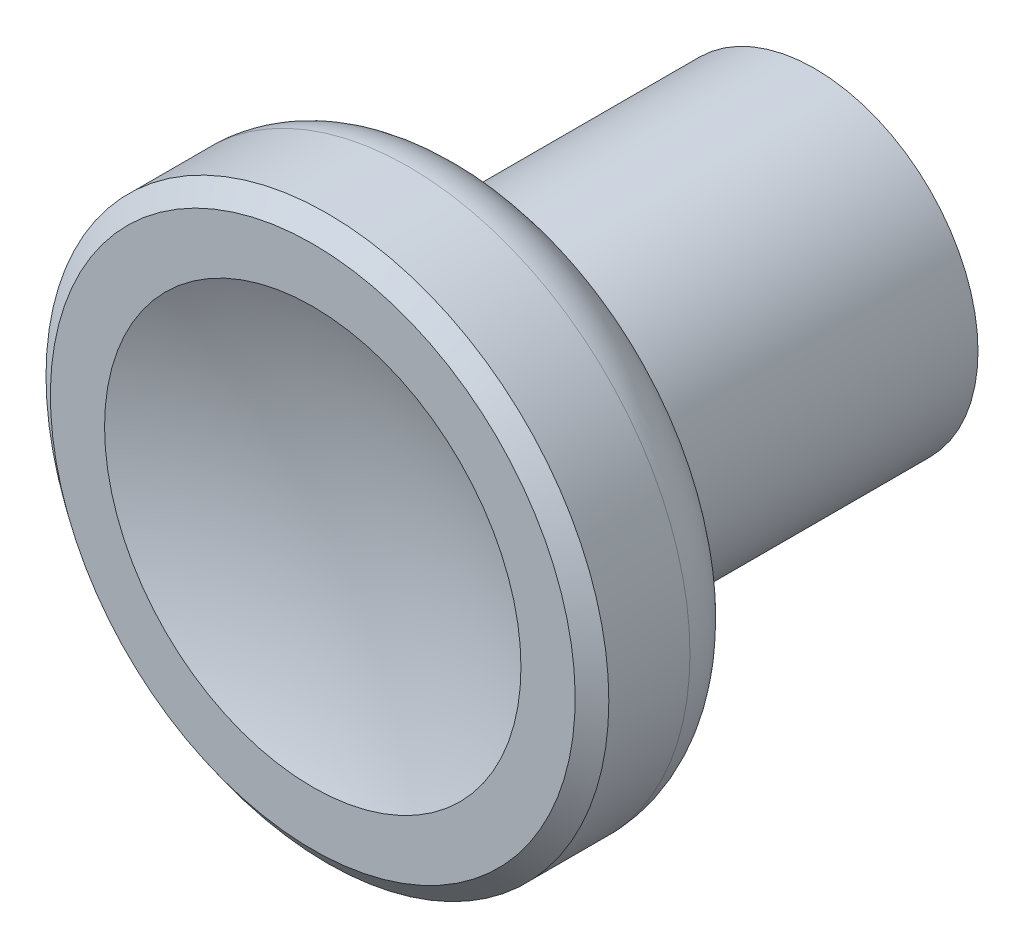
ISO-10303-21;
HEADER;
FILE_DESCRIPTION(('STEP AP214'),'2;1');
FILE_NAME('part.step','',(''),(''),'','','');
FILE_SCHEMA(('AUTOMOTIVE_DESIGN { 1 0 10303 214 1 1 1 1 }'));
ENDSEC;
DATA;
#1=APPLICATION_CONTEXT('core data for automotive mechanical design processes');
#2=APPLICATION_PROTOCOL_DEFINITION('international standard','automotive_design',2000,#1);
#3=PRODUCT_CONTEXT('',#1,'mechanical');
#4=PRODUCT('Part','Part','',(#3));
#5=PRODUCT_RELATED_PRODUCT_CATEGORY('part','',(#4));
#6=PRODUCT_DEFINITION_FORMATION('','',#4);
#7=PRODUCT_DEFINITION_CONTEXT('part definition',#1,'design');
#8=PRODUCT_DEFINITION('design','',#6,#7);
#9=PRODUCT_DEFINITION_SHAPE('','',#8);
#10=(LENGTH_UNIT() NAMED_UNIT(*) SI_UNIT(.MILLI.,.METRE.));
#11=(NAMED_UNIT(*) PLANE_ANGLE_UNIT() SI_UNIT($,.RADIAN.));
#12=(NAMED_UNIT(*) SI_UNIT($,.STERADIAN.) SOLID_ANGLE_UNIT());
#13=UNCERTAINTY_MEASURE_WITH_UNIT(LENGTH_MEASURE(1.E-05),#10,'distance_accuracy_value','');
#14=(GEOMETRIC_REPRESENTATION_CONTEXT(3) GLOBAL_UNCERTAINTY_ASSIGNED_CONTEXT((#13)) GLOBAL_UNIT_ASSIGNED_CONTEXT((#10,
#11,#12)) REPRESENTATION_CONTEXT('',''));
#15=CARTESIAN_POINT('',(0.,0.,0.));
#16=DIRECTION('',(0.,0.,1.));
#17=DIRECTION('',(1.,0.,0.));
#18=AXIS2_PLACEMENT_3D('',#15,#16,#17);
#19=CARTESIAN_POINT('',(0.,0.,43.6847281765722));
#20=DIRECTION('',(0.,-1.,0.));
#21=DIRECTION('',(1.,0.,0.));
#22=AXIS2_PLACEMENT_3D('',#19,#20,#21);
#23=SPHERICAL_SURFACE('',#22,23.1163945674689);
#24=CARTESIAN_POINT('',(0.,0.,43.6847281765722));
#25=DIRECTION('',(0.,0.,-1.));
#26=DIRECTION('',(0.,1.,0.));
#27=AXIS2_PLACEMENT_3D('',#24,#25,#26);
#28=SPHERICAL_SURFACE('',#27,23.1163945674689);
#29=CARTESIAN_POINT('',(0.,0.,22.4988392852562));
#30=DIRECTION('',(0.,0.,-1.));
#31=DIRECTION('',(0.,1.,0.));
#32=AXIS2_PLACEMENT_3D('',#29,#30,#31);
#33=CIRCLE('',#32,9.24801652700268);
#34=CARTESIAN_POINT('',(0.,9.24801652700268,22.4988392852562));
#35=VERTEX_POINT('',#34);
#36=EDGE_CURVE('E52',#35,#35,#33,.T.);
#37=ORIENTED_EDGE('',*,*,#36,.F.);
#38=EDGE_LOOP('',(#37));
#39=FACE_BOUND('',#38,.T.);
#40=ADVANCED_FACE('F12',(#39),#28,.F.);
#41=CARTESIAN_POINT('',(3.,0.,12.));
#42=DIRECTION('',(0.,0.,1.));
#43=DIRECTION('',(0.,-1.,0.));
#44=AXIS2_PLACEMENT_3D('',#41,#42,#43);
#45=PLANE('',#44);
#46=CARTESIAN_POINT('',(0.,0.,12.));
#47=DIRECTION('',(0.,0.,-1.));
#48=DIRECTION('',(0.,1.,0.));
#49=AXIS2_PLACEMENT_3D('',#46,#47,#48);
#50=CIRCLE('',#49,3.);
#51=CARTESIAN_POINT('',(0.,3.,12.));
#52=VERTEX_POINT('',#51);
#53=EDGE_CURVE('E8',#52,#52,#50,.T.);
#54=ORIENTED_EDGE('',*,*,#53,.T.);
#55=EDGE_LOOP('',(#54));
#56=FACE_BOUND('',#55,.T.);
#57=ADVANCED_FACE('F59',(#56),#45,.F.);
#58=CARTESIAN_POINT('',(0.,0.,-2.38339822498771));
#59=DIRECTION('',(0.,0.,-1.));
#60=DIRECTION('',(0.,1.,0.));
#61=AXIS2_PLACEMENT_3D('',#58,#59,#60);
#62=CYLINDRICAL_SURFACE('',#61,3.);
#63=CARTESIAN_POINT('',(0.,0.,0.));
#64=DIRECTION('',(0.,0.,-1.));
#65=DIRECTION('',(0.,1.,0.));
#66=AXIS2_PLACEMENT_3D('',#63,#64,#65);
#67=CIRCLE('',#66,3.);
#68=CARTESIAN_POINT('',(0.,3.,0.));
#69=VERTEX_POINT('',#68);
#70=EDGE_CURVE('E18',#69,#69,#67,.T.);
#71=ORIENTED_EDGE('',*,*,#70,.T.);
#72=EDGE_LOOP('',(#71));
#73=FACE_BOUND('',#72,.T.);
#74=ORIENTED_EDGE('',*,*,#53,.F.);
#75=EDGE_LOOP('',(#74));
#76=FACE_BOUND('',#75,.T.);
#77=ADVANCED_FACE('F65',(#73,#76),#62,.F.);
#78=CARTESIAN_POINT('',(3.,0.,0.));
#79=DIRECTION('',(0.,0.,-1.));
#80=DIRECTION('',(0.,1.,0.));
#81=AXIS2_PLACEMENT_3D('',#78,#79,#80);
#82=PLANE('',#81);
#83=CARTESIAN_POINT('',(0.,0.,0.));
#84=DIRECTION('',(0.,0.,-1.));
#85=DIRECTION('',(0.,1.,0.));
#86=AXIS2_PLACEMENT_3D('',#83,#84,#85);
#87=CIRCLE('',#86,4.);
#88=CARTESIAN_POINT('',(0.,4.,0.));
#89=VERTEX_POINT('',#88);
#90=EDGE_CURVE('E22',#89,#89,#87,.T.);
#91=ORIENTED_EDGE('',*,*,#90,.T.);
#92=EDGE_LOOP('',(#91));
#93=FACE_BOUND('',#92,.T.);
#94=ORIENTED_EDGE('',*,*,#70,.F.);
#95=EDGE_LOOP('',(#94));
#96=FACE_BOUND('',#95,.T.);
#97=ADVANCED_FACE('F70',(#93,#96),#82,.T.);
#98=CARTESIAN_POINT('',(0.,0.,-2.38339822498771));
#99=DIRECTION('',(0.,0.,-1.));
#100=DIRECTION('',(0.,1.,0.));
#101=AXIS2_PLACEMENT_3D('',#98,#99,#100);
#102=CYLINDRICAL_SURFACE('',#101,4.);
#103=ORIENTED_EDGE('',*,*,#90,.F.);
#104=EDGE_LOOP('',(#103));
#105=FACE_BOUND('',#104,.T.);
#106=CARTESIAN_POINT('',(0.,0.,0.200000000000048));
#107=DIRECTION('',(0.,0.,-1.));
#108=DIRECTION('',(0.,1.,0.));
#109=AXIS2_PLACEMENT_3D('',#106,#107,#108);
#110=CIRCLE('',#109,4.);
#111=CARTESIAN_POINT('',(0.,4.,0.200000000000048));
#112=VERTEX_POINT('',#111);
#113=EDGE_CURVE('E26',#112,#112,#110,.T.);
#114=ORIENTED_EDGE('',*,*,#113,.T.);
#115=EDGE_LOOP('',(#114));
#116=FACE_BOUND('',#115,.T.);
#117=ADVANCED_FACE('F75',(#105,#116),#102,.T.);
#118=CARTESIAN_POINT('',(4.,0.,0.200000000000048));
#119=DIRECTION('',(0.,0.,-1.));
#120=DIRECTION('',(0.,1.,0.));
#121=AXIS2_PLACEMENT_3D('',#118,#119,#120);
#122=PLANE('',#121);
#123=CARTESIAN_POINT('',(0.,0.,0.200000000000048));
#124=DIRECTION('',(0.,0.,-1.));
#125=DIRECTION('',(0.,1.,0.));
#126=AXIS2_PLACEMENT_3D('',#123,#124,#125);
#127=CIRCLE('',#126,7.25);
#128=CARTESIAN_POINT('',(0.,7.25,0.200000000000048));
#129=VERTEX_POINT('',#128);
#130=EDGE_CURVE('E31',#129,#129,#127,.T.);
#131=ORIENTED_EDGE('',*,*,#130,.T.);
#132=EDGE_LOOP('',(#131));
#133=FACE_BOUND('',#132,.T.);
#134=ORIENTED_EDGE('',*,*,#113,.F.);
#135=EDGE_LOOP('',(#134));
#136=FACE_BOUND('',#135,.T.);
#137=ADVANCED_FACE('F79',(#133,#136),#122,.T.);
#138=CARTESIAN_POINT('',(0.,0.,-2.38339822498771));
#139=DIRECTION('',(0.,0.,-1.));
#140=DIRECTION('',(0.,1.,0.));
#141=AXIS2_PLACEMENT_3D('',#138,#139,#140);
#142=CYLINDRICAL_SURFACE('',#141,7.25);
#143=CARTESIAN_POINT('',(0.,0.,14.));
#144=DIRECTION('',(0.,0.,-1.));
#145=DIRECTION('',(0.,1.,0.));
#146=AXIS2_PLACEMENT_3D('',#143,#144,#145);
#147=CIRCLE('',#146,7.25);
#148=CARTESIAN_POINT('',(0.,7.25,14.));
#149=VERTEX_POINT('',#148);
#150=EDGE_CURVE('E34',#149,#149,#147,.T.);
#151=ORIENTED_EDGE('',*,*,#150,.T.);
#152=EDGE_LOOP('',(#151));
#153=FACE_BOUND('',#152,.T.);
#154=ORIENTED_EDGE('',*,*,#130,.F.);
#155=EDGE_LOOP('',(#154));
#156=FACE_BOUND('',#155,.T.);
#157=ADVANCED_FACE('F83',(#153,#156),#142,.T.);
#158=CARTESIAN_POINT('',(0.,0.,14.));
#159=DIRECTION('',(0.,0.,-1.));
#160=DIRECTION('',(0.,1.,0.));
#161=AXIS2_PLACEMENT_3D('',#158,#159,#160);
#162=TOROIDAL_SURFACE('',#161,7.75,0.5);
#163=ORIENTED_EDGE('',*,*,#150,.F.);
#164=EDGE_LOOP('',(#163));
#165=FACE_BOUND('',#164,.T.);
#166=CARTESIAN_POINT('',(0.,0.,14.4670163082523));
#167=DIRECTION('',(0.,0.,-1.));
#168=DIRECTION('',(0.,1.,0.));
#169=AXIS2_PLACEMENT_3D('',#166,#167,#168);
#170=CIRCLE('',#169,7.57140613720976);
#171=CARTESIAN_POINT('',(0.,7.57140613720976,14.4670163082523));
#172=VERTEX_POINT('',#171);
#173=EDGE_CURVE('E37',#172,#172,#170,.T.);
#174=ORIENTED_EDGE('',*,*,#173,.T.);
#175=EDGE_LOOP('',(#174));
#176=FACE_BOUND('',#175,.T.);
#177=ADVANCED_FACE('F87',(#165,#176),#162,.F.);
#178=CARTESIAN_POINT('',(0.,0.,14.4670163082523));
#179=DIRECTION('',(0.,0.,1.));
#180=DIRECTION('',(0.,-1.,0.));
#181=AXIS2_PLACEMENT_3D('',#178,#179,#180);
#182=CONICAL_SURFACE('',#181,7.57140613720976,1.20554106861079);
#183=CARTESIAN_POINT('',(0.,0.,15.675774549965));
#184=DIRECTION('',(0.,0.,-1.));
#185=DIRECTION('',(0.,1.,0.));
#186=AXIS2_PLACEMENT_3D('',#183,#184,#185);
#187=CIRCLE('',#186,10.7322639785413);
#188=CARTESIAN_POINT('',(0.,10.7322639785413,15.675774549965));
#189=VERTEX_POINT('',#188);
#190=EDGE_CURVE('E40',#189,#189,#187,.T.);
#191=ORIENTED_EDGE('',*,*,#190,.T.);
#192=EDGE_LOOP('',(#191));
#193=FACE_BOUND('',#192,.T.);
#194=ORIENTED_EDGE('',*,*,#173,.F.);
#195=EDGE_LOOP('',(#194));
#196=FACE_BOUND('',#195,.T.);
#197=ADVANCED_FACE('F91',(#193,#196),#182,.T.);
#198=CARTESIAN_POINT('',(0.,0.,18.2443675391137));
#199=DIRECTION('',(0.,0.,-1.));
#200=DIRECTION('',(0.,1.,0.));
#201=AXIS2_PLACEMENT_3D('',#198,#199,#200);
#202=TOROIDAL_SURFACE('',#201,9.74999647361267,2.75000352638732);
#203=CARTESIAN_POINT('',(0.,0.,18.2443675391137));
#204=DIRECTION('',(0.,0.,-1.));
#205=DIRECTION('',(0.,1.,0.));
#206=AXIS2_PLACEMENT_3D('',#203,#204,#205);
#207=CIRCLE('',#206,12.5);
#208=CARTESIAN_POINT('',(0.,12.5,18.2443675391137));
#209=VERTEX_POINT('',#208);
#210=EDGE_CURVE('E43',#209,#209,#207,.T.);
#211=ORIENTED_EDGE('',*,*,#210,.T.);
#212=EDGE_LOOP('',(#211));
#213=FACE_BOUND('',#212,.T.);
#214=ORIENTED_EDGE('',*,*,#190,.F.);
#215=EDGE_LOOP('',(#214));
#216=FACE_BOUND('',#215,.T.);
#217=ADVANCED_FACE('F95',(#213,#216),#202,.T.);
#218=CARTESIAN_POINT('',(0.,0.,-2.38339822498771));
#219=DIRECTION('',(0.,0.,-1.));
#220=DIRECTION('',(0.,1.,0.));
#221=AXIS2_PLACEMENT_3D('',#218,#219,#220);
#222=CYLINDRICAL_SURFACE('',#221,12.5);
#223=ORIENTED_EDGE('',*,*,#210,.F.);
#224=EDGE_LOOP('',(#223));
#225=FACE_BOUND('',#224,.T.);
#226=CARTESIAN_POINT('',(0.,0.,21.8478667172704));
#227=DIRECTION('',(0.,0.,-1.));
#228=DIRECTION('',(0.,1.,0.));
#229=AXIS2_PLACEMENT_3D('',#226,#227,#228);
#230=CIRCLE('',#229,12.5);
#231=CARTESIAN_POINT('',(0.,12.5,21.8478667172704));
#232=VERTEX_POINT('',#231);
#233=EDGE_CURVE('E46',#232,#232,#230,.T.);
#234=ORIENTED_EDGE('',*,*,#233,.T.);
#235=EDGE_LOOP('',(#234));
#236=FACE_BOUND('',#235,.T.);
#237=ADVANCED_FACE('F99',(#225,#236),#222,.T.);
#238=CARTESIAN_POINT('',(0.,0.,22.4983919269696));
#239=DIRECTION('',(0.,0.,-1.));
#240=DIRECTION('',(0.,1.,0.));
#241=AXIS2_PLACEMENT_3D('',#238,#239,#240);
#242=CONICAL_SURFACE('',#241,11.6552976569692,0.914540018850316);
#243=ORIENTED_EDGE('',*,*,#233,.F.);
#244=EDGE_LOOP('',(#243));
#245=FACE_BOUND('',#244,.T.);
#246=CARTESIAN_POINT('',(0.,0.,22.4983919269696));
#247=DIRECTION('',(0.,0.,-1.));
#248=DIRECTION('',(0.,1.,0.));
#249=AXIS2_PLACEMENT_3D('',#246,#247,#248);
#250=CIRCLE('',#249,11.6552976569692);
#251=CARTESIAN_POINT('',(0.,11.6552976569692,22.4983919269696));
#252=VERTEX_POINT('',#251);
#253=EDGE_CURVE('E49',#252,#252,#250,.T.);
#254=ORIENTED_EDGE('',*,*,#253,.T.);
#255=EDGE_LOOP('',(#254));
#256=FACE_BOUND('',#255,.T.);
#257=ADVANCED_FACE('F103',(#245,#256),#242,.T.);
#258=CARTESIAN_POINT('',(0.,0.,22.4988392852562));
#259=DIRECTION('',(0.,0.,-1.));
#260=DIRECTION('',(0.,1.,0.));
#261=AXIS2_PLACEMENT_3D('',#258,#259,#260);
#262=CONICAL_SURFACE('',#261,9.24801652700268,1.57061049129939);
#263=ORIENTED_EDGE('',*,*,#253,.F.);
#264=EDGE_LOOP('',(#263));
#265=FACE_BOUND('',#264,.T.);
#266=ORIENTED_EDGE('',*,*,#36,.T.);
#267=EDGE_LOOP('',(#266));
#268=FACE_BOUND('',#267,.T.);
#269=ADVANCED_FACE('F56',(#265,#268),#262,.T.);
#270=CLOSED_SHELL('',(#40,#57,#77,#97,#117,#137,#157,#177,#197,#217,#237,#257,#269));
#271=MANIFOLD_SOLID_BREP('B1',#270);
#272=ADVANCED_BREP_SHAPE_REPRESENTATION('',(#18,#271),#14);
#273=SHAPE_DEFINITION_REPRESENTATION(#9,#272);
ENDSEC;
END-ISO-10303-21;
